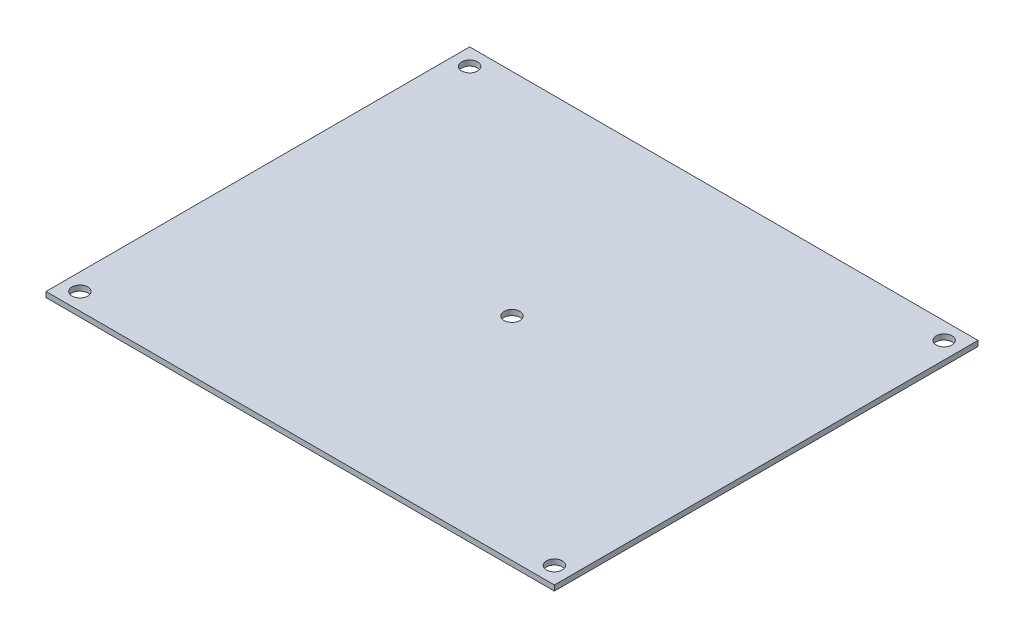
from build123d import *

# Parameters (mm, degrees)
SKETCH1_W          = 152.4
SKETCH1_H          = 127
EXTRUDE1_DEPTH     = 1.6002
SKETCH2_R          = 2.3749
CUT_EXTRUDE1_DEPTH = 100.203077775


with BuildPart() as part:
    # Sketch1 → Extrude1 (new body)
    with BuildSketch(Plane(origin=(0, 0, 0), x_dir=(1, 0, 0), z_dir=(0, 1, 0))):
        Rectangle(SKETCH1_W, SKETCH1_H)
    extrude(amount=EXTRUDE1_DEPTH)

    # Sketch2 → Cut-Extrude1 (cut, through all)
    with BuildSketch(Plane(origin=(0, 1.6002, 0), x_dir=(-1, 0, 0), z_dir=(0, 1, 0))):
        with Locations(Location((-71.12, -58.42, 0), (0, 0, 90))):
            Circle(SKETCH2_R)
        with Locations(Location((71.12, -58.42, 0), (0, 0, 90))):
            Circle(SKETCH2_R)
        with Locations(Location((71.12, 58.42, 0), (0, 0, 90))):
            Circle(SKETCH2_R)
        with Locations(Location((-71.12, 58.42, 0), (0, 0, 90))):
            Circle(SKETCH2_R)
        with Locations(Location((0, 0, 0), (0, 0, 90))):
            Circle(SKETCH2_R)
    extrude(amount=-CUT_EXTRUDE1_DEPTH, mode=Mode.SUBTRACT)


solid = part.part
